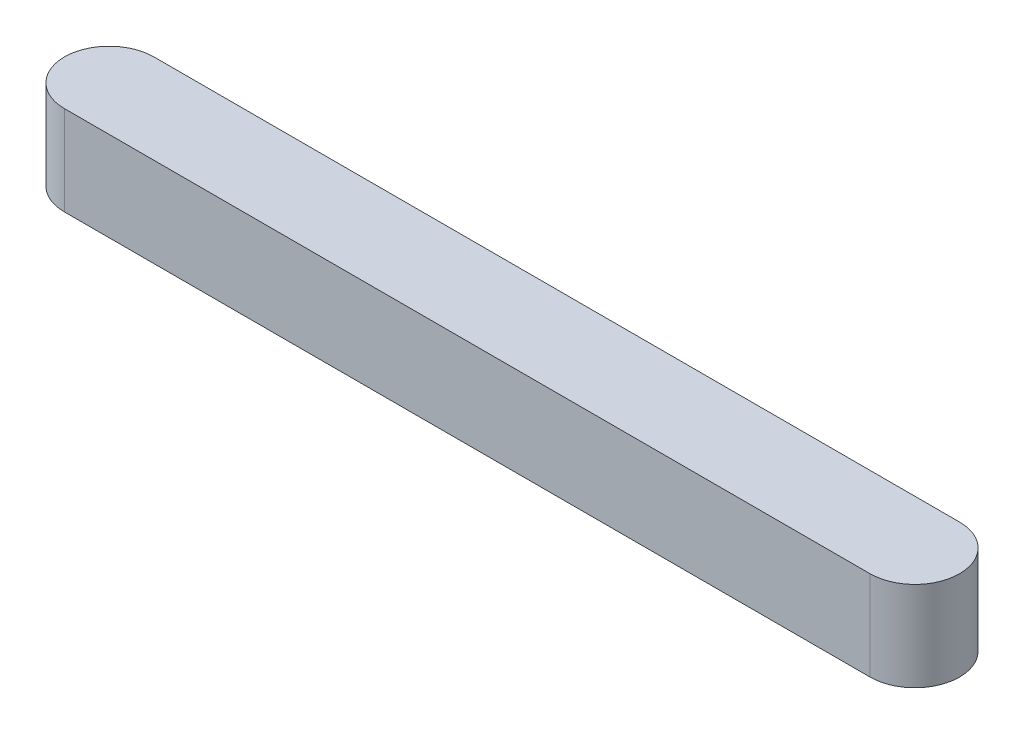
from build123d import *

# Parameters (mm, degrees)
BOSS_EXTRUDE1_DEPTH = 2


with BuildPart() as part:
    # Sketch1 → Boss-Extrude1 (new body)
    with BuildSketch(Plane(origin=(0, 0, 0), x_dir=(1, 0, 0), z_dir=(0, 1, 0))):
        with BuildLine():
            Line((0, 0), (18, 0))
            ThreePointArc((18, 0), (19, 1), (18, 2))
            Line((18, 2), (0, 2))
            ThreePointArc((0, 2), (-1, 1), (0, 0))
        make_face()
    extrude(amount=BOSS_EXTRUDE1_DEPTH)


solid = part.part
